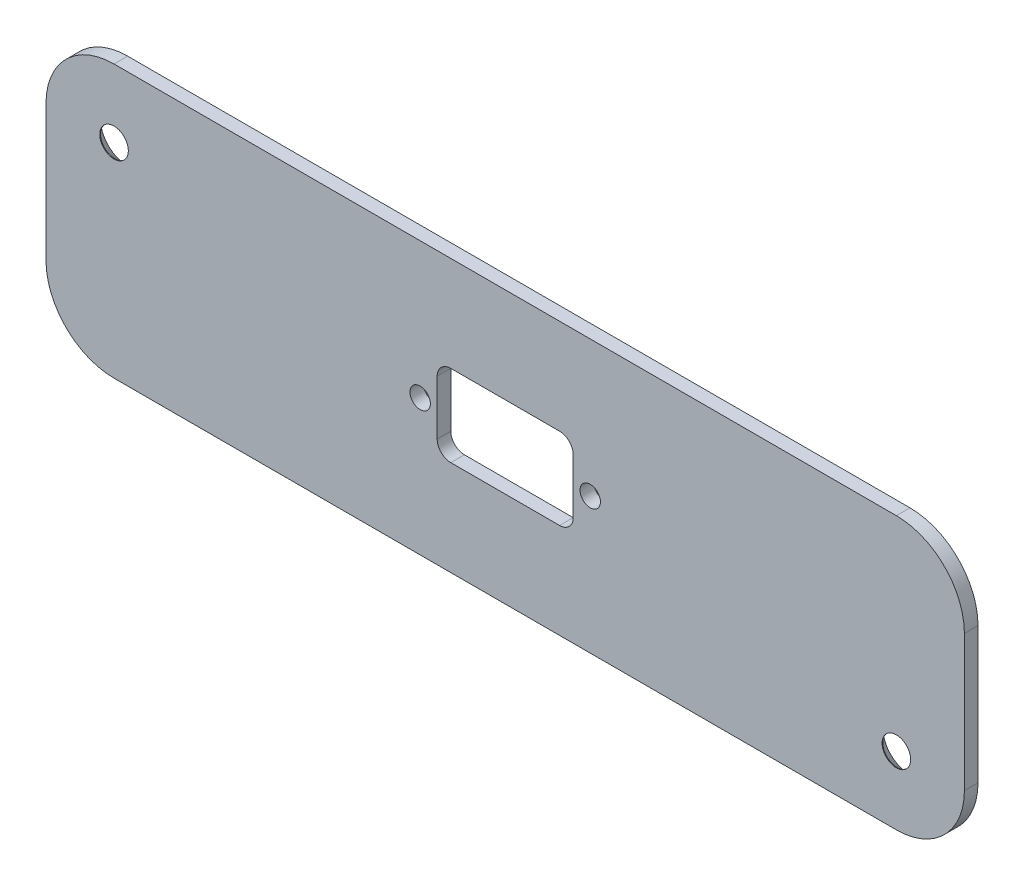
from build123d import *

# Parameters (mm, degrees)
ESQUISSE1_W             = 135
ESQUISSE1_H             = 40
BOSS_EXTRU_1_DEPTH      = 2
ESQUISSE2_R             = 2.1
ENL_V_MAT_EXTRU_1_DEPTH = 2
CHANFREIN1_SIZE         = 1.9
ESQUISSE3_R             = 1.5
ESQUISSE3_W             = 20
ESQUISSE3_H             = 12
ENL_V_MAT_EXTRU_2_DEPTH = 141.815482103
CONG_2_R                = 2
CONG_3_R                = 10
ENL_V_MAT_EXTRU_3_DEPTH = 1


with BuildPart() as part:
    # Esquisse1 → Boss.-Extru.1 (new body)
    with BuildSketch(Plane.XY):
        with Locations((67.5, 20)):
            Rectangle(ESQUISSE1_W, ESQUISSE1_H)
    extrude(amount=BOSS_EXTRU_1_DEPTH)

    # Esquisse2 → Enl_v. mat.-Extru.1 (cut)
    with BuildSketch(Plane.XY.offset(2)):
        with Locations((10, 30)):
            Circle(ESQUISSE2_R)
        with Locations((125, 10)):
            Circle(ESQUISSE2_R)
    extrude(amount=-ENL_V_MAT_EXTRU_1_DEPTH, mode=Mode.SUBTRACT)

    # Chanfrein1
    chanfrein1_edges = [part.edges().sort_by_distance(p)[0] for p in [
        (7.9, 30, 0),
        (122.9, 10, 0),
    ]]
    chamfer(chanfrein1_edges, length=CHANFREIN1_SIZE)

    # Esquisse3 → Enl_v. mat.-Extru.2 (cut, through all)
    with BuildSketch(Plane(origin=(0, 0, 0), x_dir=(-1, 0, 0), z_dir=(0, 0, -1))):
        with Locations((-80, 20)):
            Circle(ESQUISSE3_R)
        with Locations((-55, 20)):
            Circle(ESQUISSE3_R)
        with Locations((-67.5, 20)):
            Rectangle(ESQUISSE3_W, ESQUISSE3_H)
    extrude(amount=-ENL_V_MAT_EXTRU_2_DEPTH, mode=Mode.SUBTRACT)

    # Cong_2
    cong_2_edges = [part.edges().sort_by_distance(p)[0] for p in [
        (77.5, 14, 1),
        (77.5, 26, 1),
        (57.5, 26, 1),
        (57.5, 14, 1),
    ]]
    fillet(cong_2_edges, radius=CONG_2_R)

    # Cong_3
    cong_3_edges = [part.edges().sort_by_distance(p)[0] for p in [
        (0, 40, 1),
        (135, 40, 1),
        (135, 0, 1),
        (0, 0, 1),
    ]]
    fillet(cong_3_edges, radius=CONG_3_R)

    # Esquisse4 → Enl_v. mat.-Extru.3 (cut)
    with BuildSketch(Plane(origin=(0, 0, 0), x_dir=(-1, 0, 0), z_dir=(0, 0, -1))):
        with BuildLine():
            Line((-74.464212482, 7.81269007), (-74.778315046, 7.81269007))
            add(Edge.make_bspline(
                [(-74.778315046, 7.81269007), (-74.776267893, 7.854360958), (-74.772247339, 7.936201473), (-74.753419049, 8.055525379), (-74.726478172, 8.169580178), (-74.688386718, 8.277450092), (-74.64108044, 8.380088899), (-74.584350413, 8.477088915), (-74.517156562, 8.568080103), (-74.440949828, 8.652218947), (-74.358181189, 8.729406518), (-74.26887525, 8.79606176), (-74.175030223, 8.852379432), (-74.076930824, 8.899460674), (-73.97347026, 8.934800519), (-73.865587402, 8.961022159), (-73.752808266, 8.976798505), (-73.675968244, 8.97849429), (-73.636888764, 8.979356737)],
                knots=[0, 0, 0, 0, 1.10065271, 2.161652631, 3.183658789, 4.190468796, 5.17591951, 6.163126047, 7.15150782, 8.156236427, 9.156009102, 10.134482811, 11.092018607, 12.041330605, 13.001268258, 13.972401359, 14.968799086, 16, 16, 16, 16], degree=3))
            add(Edge.make_bspline(
                [(-73.636888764, 8.979356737), (-73.59851069, 8.978458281), (-73.523099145, 8.976692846), (-73.41303713, 8.961531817), (-73.308259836, 8.937786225), (-73.208972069, 8.904470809), (-73.115966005, 8.859686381), (-73.02854296, 8.805888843), (-72.94566215, 8.743669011), (-72.871055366, 8.670415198), (-72.802547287, 8.592212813), (-72.743445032, 8.50872491), (-72.692831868, 8.422495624), (-72.650644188, 8.332867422), (-72.619588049, 8.238996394), (-72.596009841, 8.142249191), (-72.582682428, 8.04162438), (-72.580637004, 7.973517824), (-72.579597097, 7.938891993)],
                knots=[0, 0, 0, 0, 1.111607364, 2.184268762, 3.212621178, 4.221274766, 5.211760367, 6.196651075, 7.1921475, 8.207485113, 9.220403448, 10.201281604, 11.166441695, 12.114753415, 13.065576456, 14.026450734, 14.996634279, 16, 16, 16, 16], degree=3))
            add(Edge.make_bspline(
                [(-72.579597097, 7.938891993), (-72.58129036, 7.890144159), (-72.584647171, 7.793503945), (-72.613361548, 7.651489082), (-72.658208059, 7.513895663), (-72.712205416, 7.403158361), (-72.76667786, 7.313924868), (-72.815765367, 7.240456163), (-72.873230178, 7.161350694), (-72.939908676, 7.076873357), (-73.014421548, 6.986362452), (-73.097443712, 6.889872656), (-73.189567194, 6.788400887), (-73.254225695, 6.719095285), (-73.28773011, 6.683182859)],
                knots=[0, 0, 0, 0, 1.184426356, 2.348067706, 3.509069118, 4.696110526, 5.333549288, 6.050745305, 6.844228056, 7.710549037, 8.667450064, 9.695053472, 10.805634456, 12, 12, 12, 12], degree=3))
            Line((-73.28773011, 6.683182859), (-74.163431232, 5.748587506))
            Line((-74.163431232, 5.748587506), (-72.534725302, 5.748587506))
            Line((-72.534725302, 5.748587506), (-72.534725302, 5.389613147))
            Line((-72.534725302, 5.389613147), (-74.91293043, 5.389613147))
            Line((-74.91293043, 5.389613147), (-73.555558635, 6.838130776))
            add(Edge.make_bspline(
                [(-73.555558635, 6.838130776), (-73.522510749, 6.872629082), (-73.459032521, 6.938893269), (-73.369249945, 7.035636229), (-73.288610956, 7.12538577), (-73.216593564, 7.207972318), (-73.154760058, 7.284603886), (-73.099887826, 7.352798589), (-73.055922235, 7.41555304), (-73.00820684, 7.488293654), (-72.961992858, 7.577105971), (-72.922280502, 7.68563966), (-72.898065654, 7.797366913), (-72.895160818, 7.87286895), (-72.893699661, 7.910847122)],
                knots=[0, 0, 0, 0, 1.329631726, 2.553950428, 3.673215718, 4.687767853, 5.603093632, 6.413772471, 7.123043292, 7.734684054, 8.834405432, 9.900288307, 10.943827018, 12, 12, 12, 12], degree=3))
            add(Edge.make_bspline(
                [(-72.893699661, 7.910847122), (-72.894335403, 7.93472852), (-72.895588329, 7.98179417), (-72.906646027, 8.050799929), (-72.923356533, 8.117364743), (-72.947301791, 8.181693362), (-72.978908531, 8.243139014), (-73.017381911, 8.301776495), (-73.061771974, 8.35846546), (-73.113123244, 8.411618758), (-73.169534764, 8.460299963), (-73.229129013, 8.503424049), (-73.292179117, 8.53946316), (-73.35841924, 8.569006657), (-73.427664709, 8.592182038), (-73.500049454, 8.608240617), (-73.57537347, 8.618323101), (-73.626806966, 8.619687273), (-73.653014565, 8.620382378)],
                knots=[0, 0, 0, 0, 0.991446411, 1.95395049, 2.89581595, 3.838931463, 4.798493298, 5.75982156, 6.748411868, 7.785213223, 8.824556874, 9.840280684, 10.836137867, 11.835679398, 12.848801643, 13.863922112, 14.911575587, 16, 16, 16, 16], degree=3))
            add(Edge.make_bspline(
                [(-73.653014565, 8.620382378), (-73.680385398, 8.619667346), (-73.734137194, 8.618263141), (-73.813056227, 8.608440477), (-73.888342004, 8.591494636), (-73.960183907, 8.568317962), (-74.028703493, 8.538859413), (-74.093567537, 8.502167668), (-74.154630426, 8.458384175), (-74.21200695, 8.408743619), (-74.264870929, 8.353476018), (-74.311317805, 8.291866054), (-74.351901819, 8.225038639), (-74.387311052, 8.153174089), (-74.416066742, 8.075620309), (-74.438039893, 7.992652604), (-74.45542674, 7.904631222), (-74.46123526, 7.843846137), (-74.464212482, 7.81269007)],
                knots=[0, 0, 0, 0, 1.031018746, 2.02475058, 2.990194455, 3.934040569, 4.864654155, 5.795059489, 6.735614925, 7.690564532, 8.649604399, 9.611025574, 10.590972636, 11.591080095, 12.624614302, 13.701020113, 14.821632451, 16, 16, 16, 16], degree=3))
        make_face()
        Polygon((-71.996263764, 8.889613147), (-69.84241761, 8.889613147), (-71.6821612, 5.299869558), (-71.953495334, 5.4492085), (-70.37386793, 8.530638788), (-71.996263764, 8.530638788), align=None)
        Polygon((-68.137289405, 8.889613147), (-67.800750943, 8.889613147), (-66.634084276, 6.131400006), (-65.46741761, 8.889613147), (-65.130879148, 8.889613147), (-66.611648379, 5.389613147), (-66.656520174, 5.389613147), align=None)
        with BuildLine():
            Line((-61.271904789, 8.247385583), (-61.546744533, 8.037049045))
            add(Edge.make_bspline(
                [(-61.546744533, 8.037049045), (-61.566350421, 8.060415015), (-61.605297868, 8.10683193), (-61.667957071, 8.172011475), (-61.733258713, 8.233076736), (-61.801177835, 8.290318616), (-61.872936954, 8.341735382), (-61.946797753, 8.390006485), (-62.023995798, 8.433274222), (-62.130747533, 8.485737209), (-62.270395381, 8.540483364), (-62.44619022, 8.586386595), (-62.629701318, 8.615607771), (-62.754898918, 8.618772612), (-62.818579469, 8.620382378)],
                knots=[0, 0, 0, 0, 0.757959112, 1.505699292, 2.245454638, 2.979532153, 3.711538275, 4.438200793, 5.171680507, 5.909471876, 7.393775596, 8.890124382, 10.418191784, 12, 12, 12, 12], degree=3))
            add(Edge.make_bspline(
                [(-62.818579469, 8.620382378), (-62.853662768, 8.619978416), (-62.923503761, 8.61917424), (-63.027152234, 8.608565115), (-63.128865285, 8.593653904), (-63.228576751, 8.571528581), (-63.32615971, 8.543555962), (-63.422252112, 8.510130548), (-63.515462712, 8.468775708), (-63.60708095, 8.423067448), (-63.694860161, 8.371440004), (-63.777915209, 8.315126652), (-63.855943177, 8.254757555), (-63.929005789, 8.190106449), (-63.997177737, 8.121464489), (-64.059965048, 8.048100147), (-64.117150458, 7.970247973), (-64.169867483, 7.888934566), (-64.217080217, 7.804396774), (-64.256610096, 7.716321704), (-64.291615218, 7.626217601), (-64.319314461, 7.53306644), (-64.341238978, 7.437523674), (-64.356366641, 7.339332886), (-64.366855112, 7.238699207), (-64.367655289, 7.170489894), (-64.368058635, 7.136107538)],
                knots=[0, 0, 0, 0, 1.054917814, 2.100044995, 3.131103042, 4.146048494, 5.169673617, 6.183595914, 7.203665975, 8.234915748, 9.262203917, 10.264457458, 11.251630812, 12.227803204, 13.197192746, 14.159520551, 15.12972552, 16.100847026, 17.073214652, 18.039054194, 19.002613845, 19.979014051, 20.95965708, 21.949030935, 22.966165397, 24, 24, 24, 24], degree=3))
            add(Edge.make_bspline(
                [(-64.368058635, 7.136107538), (-64.366796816, 7.084376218), (-64.364319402, 6.982808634), (-64.342271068, 6.834038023), (-64.308765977, 6.691517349), (-64.2585504, 6.556137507), (-64.196631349, 6.426229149), (-64.118390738, 6.303990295), (-64.0277742, 6.187573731), (-63.923499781, 6.079730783), (-63.809093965, 5.981217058), (-63.686346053, 5.894466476), (-63.555561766, 5.822151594), (-63.418185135, 5.761975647), (-63.273159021, 5.71571892), (-63.120744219, 5.683154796), (-62.961272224, 5.661912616), (-62.852302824, 5.659878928), (-62.796844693, 5.658843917)],
                knots=[0, 0, 0, 0, 1.029171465, 2.020641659, 2.987623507, 3.938342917, 4.889210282, 5.84687017, 6.821220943, 7.821438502, 8.827599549, 9.822697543, 10.807740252, 11.797342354, 12.80366471, 13.83203677, 14.896651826, 16, 16, 16, 16], degree=3))
            add(Edge.make_bspline(
                [(-62.796844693, 5.658843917), (-62.735742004, 5.660532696), (-62.615477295, 5.663856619), (-62.439109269, 5.692015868), (-62.270273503, 5.737673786), (-62.108960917, 5.801571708), (-61.95562627, 5.884636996), (-61.81002961, 5.985334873), (-61.67204804, 6.104623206), (-61.589076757, 6.195706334), (-61.546744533, 6.24217725)],
                knots=[0, 0, 0, 0, 1.028121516, 2.023589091, 2.998037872, 3.967518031, 4.937445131, 5.927275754, 6.942489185, 8, 8, 8, 8], degree=3))
            Line((-61.546744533, 6.24217725), (-61.271904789, 6.033944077))
            add(Edge.make_bspline(
                [(-61.271904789, 6.033944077), (-61.294022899, 6.005405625), (-61.338153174, 5.948465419), (-61.409611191, 5.868193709), (-61.484888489, 5.792689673), (-61.564544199, 5.722562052), (-61.64766199, 5.656407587), (-61.735734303, 5.596105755), (-61.827603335, 5.540814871), (-61.922957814, 5.490187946), (-62.021696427, 5.445270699), (-62.123700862, 5.406816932), (-62.228531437, 5.373692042), (-62.336192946, 5.346440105), (-62.446908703, 5.325169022), (-62.560279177, 5.310949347), (-62.676549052, 5.301207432), (-62.754990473, 5.300319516), (-62.794741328, 5.299869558)],
                knots=[0, 0, 0, 0, 0.986787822, 1.968848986, 2.935600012, 3.899624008, 4.868462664, 5.837806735, 6.815139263, 7.798259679, 8.787526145, 9.778297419, 10.776456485, 11.791383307, 12.812564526, 13.85620153, 14.913611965, 16, 16, 16, 16], degree=3))
            add(Edge.make_bspline(
                [(-62.794741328, 5.299869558), (-62.832384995, 5.30013155), (-62.906820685, 5.300649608), (-63.016719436, 5.309041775), (-63.123709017, 5.320491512), (-63.227483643, 5.337731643), (-63.328609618, 5.358075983), (-63.426170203, 5.38534724), (-63.521125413, 5.415896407), (-63.613093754, 5.451801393), (-63.702153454, 5.492317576), (-63.788017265, 5.538109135), (-63.870645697, 5.588790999), (-63.950851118, 5.64324601), (-64.027448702, 5.703223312), (-64.101102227, 5.767889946), (-64.172224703, 5.837027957), (-64.216227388, 5.88688281), (-64.238351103, 5.911948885)],
                knots=[0, 0, 0, 0, 1.114604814, 2.203992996, 3.262667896, 4.300477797, 5.318619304, 6.316056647, 7.298880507, 8.271930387, 9.238335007, 10.195173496, 11.151986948, 12.108099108, 13.064862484, 14.031167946, 15.010108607, 16, 16, 16, 16], degree=3))
            add(Edge.make_bspline(
                [(-64.238351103, 5.911948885), (-64.273786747, 5.955490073), (-64.344230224, 6.042046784), (-64.434355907, 6.182332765), (-64.511503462, 6.328800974), (-64.573879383, 6.482220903), (-64.622642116, 6.64224829), (-64.656423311, 6.808963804), (-64.678374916, 6.982211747), (-64.680885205, 7.100048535), (-64.6821612, 7.159945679)],
                knots=[0, 0, 0, 0, 0.994628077, 1.977248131, 2.950237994, 3.925870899, 4.908910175, 5.911660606, 6.938484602, 8, 8, 8, 8], degree=3))
            add(Edge.make_bspline(
                [(-64.6821612, 7.159945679), (-64.680606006, 7.222901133), (-64.67754626, 7.346762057), (-64.651550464, 7.528536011), (-64.609731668, 7.70268741), (-64.550334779, 7.868891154), (-64.475029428, 8.028021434), (-64.382002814, 8.178862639), (-64.272335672, 8.322379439), (-64.146888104, 8.45639419), (-64.009320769, 8.578933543), (-63.862001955, 8.686739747), (-63.705220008, 8.776457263), (-63.540702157, 8.851453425), (-63.367216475, 8.909097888), (-63.185133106, 8.949451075), (-62.994794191, 8.974568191), (-62.864931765, 8.977743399), (-62.798948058, 8.979356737)],
                knots=[0, 0, 0, 0, 1.032925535, 2.032216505, 3.007276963, 3.968222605, 4.92396291, 5.891752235, 6.871517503, 7.883894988, 8.900124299, 9.891468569, 10.874487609, 11.85992873, 12.854644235, 13.869047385, 14.917252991, 16, 16, 16, 16], degree=3))
            add(Edge.make_bspline(
                [(-62.798948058, 8.979356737), (-62.758733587, 8.978874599), (-62.679133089, 8.977920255), (-62.561380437, 8.968614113), (-62.44673811, 8.953100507), (-62.335127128, 8.931984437), (-62.226004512, 8.905777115), (-62.120204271, 8.871636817), (-62.017105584, 8.832600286), (-61.917358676, 8.78764182), (-61.821442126, 8.737175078), (-61.729385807, 8.681759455), (-61.641920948, 8.621463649), (-61.5584321, 8.556800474), (-61.480315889, 8.486401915), (-61.40535441, 8.412204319), (-61.336093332, 8.332070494), (-61.293340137, 8.27566556), (-61.271904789, 8.247385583)],
                knots=[0, 0, 0, 0, 1.096760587, 2.17092713, 3.219439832, 4.250915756, 5.268269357, 6.278326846, 7.281116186, 8.274029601, 9.260640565, 10.235837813, 11.203064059, 12.156899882, 13.114053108, 14.069676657, 15.032185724, 16, 16, 16, 16], degree=3))
        make_face()
    extrude(amount=-ENL_V_MAT_EXTRU_3_DEPTH, mode=Mode.SUBTRACT)


solid = part.part
